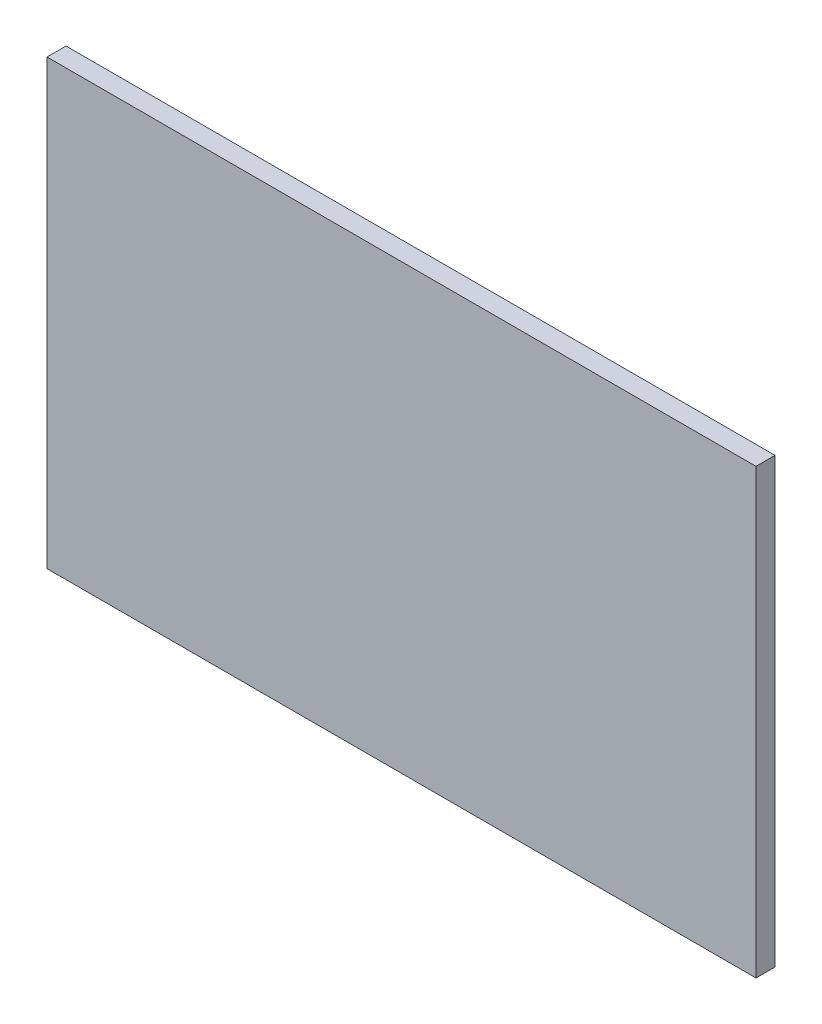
ISO-10303-21;
HEADER;
FILE_DESCRIPTION(('STEP AP214'),'2;1');
FILE_NAME('part.step','',(''),(''),'','','');
FILE_SCHEMA(('AUTOMOTIVE_DESIGN { 1 0 10303 214 1 1 1 1 }'));
ENDSEC;
DATA;
#1=APPLICATION_CONTEXT('core data for automotive mechanical design processes');
#2=APPLICATION_PROTOCOL_DEFINITION('international standard','automotive_design',2000,#1);
#3=PRODUCT_CONTEXT('',#1,'mechanical');
#4=PRODUCT('Part','Part','',(#3));
#5=PRODUCT_RELATED_PRODUCT_CATEGORY('part','',(#4));
#6=PRODUCT_DEFINITION_FORMATION('','',#4);
#7=PRODUCT_DEFINITION_CONTEXT('part definition',#1,'design');
#8=PRODUCT_DEFINITION('design','',#6,#7);
#9=PRODUCT_DEFINITION_SHAPE('','',#8);
#10=(LENGTH_UNIT() NAMED_UNIT(*) SI_UNIT(.MILLI.,.METRE.));
#11=(NAMED_UNIT(*) PLANE_ANGLE_UNIT() SI_UNIT($,.RADIAN.));
#12=(NAMED_UNIT(*) SI_UNIT($,.STERADIAN.) SOLID_ANGLE_UNIT());
#13=UNCERTAINTY_MEASURE_WITH_UNIT(LENGTH_MEASURE(1.E-05),#10,'distance_accuracy_value','');
#14=(GEOMETRIC_REPRESENTATION_CONTEXT(3) GLOBAL_UNCERTAINTY_ASSIGNED_CONTEXT((#13)) GLOBAL_UNIT_ASSIGNED_CONTEXT((#10,
#11,#12)) REPRESENTATION_CONTEXT('',''));
#15=CARTESIAN_POINT('',(0.,0.,0.));
#16=DIRECTION('',(0.,0.,1.));
#17=DIRECTION('',(1.,0.,0.));
#18=AXIS2_PLACEMENT_3D('',#15,#16,#17);
#19=CARTESIAN_POINT('',(0.,35.,1.5));
#20=DIRECTION('',(1.,0.,0.));
#21=DIRECTION('',(0.,1.,0.));
#22=AXIS2_PLACEMENT_3D('',#19,#20,#21);
#23=PLANE('',#22);
#24=DIRECTION('',(0.,-1.,0.));
#25=VECTOR('',#24,1.);
#26=CARTESIAN_POINT('',(0.,35.,0.));
#27=LINE('',#26,#25);
#28=CARTESIAN_POINT('',(0.,35.,0.));
#29=VERTEX_POINT('',#28);
#30=CARTESIAN_POINT('',(0.,0.,0.));
#31=VERTEX_POINT('',#30);
#32=EDGE_CURVE('E392',#29,#31,#27,.T.);
#33=ORIENTED_EDGE('',*,*,#32,.T.);
#34=DIRECTION('',(0.,0.,-1.));
#35=VECTOR('',#34,1.);
#36=CARTESIAN_POINT('',(0.,0.,1.5));
#37=LINE('',#36,#35);
#38=CARTESIAN_POINT('',(0.,0.,1.5));
#39=VERTEX_POINT('',#38);
#40=EDGE_CURVE('E11',#39,#31,#37,.T.);
#41=ORIENTED_EDGE('',*,*,#40,.F.);
#42=DIRECTION('',(0.,-1.,0.));
#43=VECTOR('',#42,1.);
#44=CARTESIAN_POINT('',(0.,35.,1.5));
#45=LINE('',#44,#43);
#46=CARTESIAN_POINT('',(0.,35.,1.5));
#47=VERTEX_POINT('',#46);
#48=EDGE_CURVE('E410',#47,#39,#45,.T.);
#49=ORIENTED_EDGE('',*,*,#48,.F.);
#50=DIRECTION('',(0.,0.,-1.));
#51=VECTOR('',#50,1.);
#52=CARTESIAN_POINT('',(0.,35.,1.5));
#53=LINE('',#52,#51);
#54=EDGE_CURVE('E404',#47,#29,#53,.T.);
#55=ORIENTED_EDGE('',*,*,#54,.T.);
#56=EDGE_LOOP('',(#33,#41,#49,#55));
#57=FACE_BOUND('',#56,.T.);
#58=ADVANCED_FACE('F348',(#57),#23,.F.);
#59=CARTESIAN_POINT('',(0.,0.,1.5));
#60=DIRECTION('',(0.,1.,0.));
#61=DIRECTION('',(-1.,0.,0.));
#62=AXIS2_PLACEMENT_3D('',#59,#60,#61);
#63=PLANE('',#62);
#64=DIRECTION('',(1.,0.,0.));
#65=VECTOR('',#64,1.);
#66=CARTESIAN_POINT('',(0.,0.,0.));
#67=LINE('',#66,#65);
#68=CARTESIAN_POINT('',(56.,0.,0.));
#69=VERTEX_POINT('',#68);
#70=EDGE_CURVE('E388',#31,#69,#67,.T.);
#71=ORIENTED_EDGE('',*,*,#70,.T.);
#72=DIRECTION('',(0.,0.,-1.));
#73=VECTOR('',#72,1.);
#74=CARTESIAN_POINT('',(56.,0.,1.5));
#75=LINE('',#74,#73);
#76=CARTESIAN_POINT('',(56.,0.,1.5));
#77=VERTEX_POINT('',#76);
#78=EDGE_CURVE('E355',#77,#69,#75,.T.);
#79=ORIENTED_EDGE('',*,*,#78,.F.);
#80=DIRECTION('',(1.,0.,0.));
#81=VECTOR('',#80,1.);
#82=CARTESIAN_POINT('',(0.,0.,1.5));
#83=LINE('',#82,#81);
#84=EDGE_CURVE('E400',#39,#77,#83,.T.);
#85=ORIENTED_EDGE('',*,*,#84,.F.);
#86=ORIENTED_EDGE('',*,*,#40,.T.);
#87=EDGE_LOOP('',(#71,#79,#85,#86));
#88=FACE_BOUND('',#87,.T.);
#89=ADVANCED_FACE('F399',(#88),#63,.F.);
#90=CARTESIAN_POINT('',(56.,35.,1.5));
#91=DIRECTION('',(-1.,0.,0.));
#92=DIRECTION('',(0.,-1.,0.));
#93=AXIS2_PLACEMENT_3D('',#90,#91,#92);
#94=PLANE('',#93);
#95=DIRECTION('',(0.,1.,0.));
#96=VECTOR('',#95,1.);
#97=CARTESIAN_POINT('',(56.,35.,0.));
#98=LINE('',#97,#96);
#99=CARTESIAN_POINT('',(56.,35.,0.));
#100=VERTEX_POINT('',#99);
#101=EDGE_CURVE('E393',#69,#100,#98,.T.);
#102=ORIENTED_EDGE('',*,*,#101,.T.);
#103=DIRECTION('',(0.,0.,-1.));
#104=VECTOR('',#103,1.);
#105=CARTESIAN_POINT('',(56.,35.,1.5));
#106=LINE('',#105,#104);
#107=CARTESIAN_POINT('',(56.,35.,1.5));
#108=VERTEX_POINT('',#107);
#109=EDGE_CURVE('E416',#108,#100,#106,.T.);
#110=ORIENTED_EDGE('',*,*,#109,.F.);
#111=DIRECTION('',(0.,1.,0.));
#112=VECTOR('',#111,1.);
#113=CARTESIAN_POINT('',(56.,35.,1.5));
#114=LINE('',#113,#112);
#115=EDGE_CURVE('E367',#77,#108,#114,.T.);
#116=ORIENTED_EDGE('',*,*,#115,.F.);
#117=ORIENTED_EDGE('',*,*,#78,.T.);
#118=EDGE_LOOP('',(#102,#110,#116,#117));
#119=FACE_BOUND('',#118,.T.);
#120=ADVANCED_FACE('F419',(#119),#94,.F.);
#121=CARTESIAN_POINT('',(0.,35.,1.5));
#122=DIRECTION('',(0.,-1.,0.));
#123=DIRECTION('',(0.,0.,-1.));
#124=AXIS2_PLACEMENT_3D('',#121,#122,#123);
#125=PLANE('',#124);
#126=DIRECTION('',(-1.,0.,0.));
#127=VECTOR('',#126,1.);
#128=CARTESIAN_POINT('',(0.,35.,0.));
#129=LINE('',#128,#127);
#130=EDGE_CURVE('E408',#100,#29,#129,.T.);
#131=ORIENTED_EDGE('',*,*,#130,.T.);
#132=ORIENTED_EDGE('',*,*,#54,.F.);
#133=DIRECTION('',(-1.,0.,0.));
#134=VECTOR('',#133,1.);
#135=CARTESIAN_POINT('',(0.,35.,1.5));
#136=LINE('',#135,#134);
#137=EDGE_CURVE('E362',#108,#47,#136,.T.);
#138=ORIENTED_EDGE('',*,*,#137,.F.);
#139=ORIENTED_EDGE('',*,*,#109,.T.);
#140=EDGE_LOOP('',(#131,#132,#138,#139));
#141=FACE_BOUND('',#140,.T.);
#142=ADVANCED_FACE('F421',(#141),#125,.F.);
#143=CARTESIAN_POINT('',(0.,35.,1.5));
#144=DIRECTION('',(0.,0.,1.));
#145=DIRECTION('',(1.,0.,0.));
#146=AXIS2_PLACEMENT_3D('',#143,#144,#145);
#147=PLANE('',#146);
#148=ORIENTED_EDGE('',*,*,#48,.T.);
#149=ORIENTED_EDGE('',*,*,#84,.T.);
#150=ORIENTED_EDGE('',*,*,#115,.T.);
#151=ORIENTED_EDGE('',*,*,#137,.T.);
#152=EDGE_LOOP('',(#148,#149,#150,#151));
#153=FACE_BOUND('',#152,.T.);
#154=ADVANCED_FACE('F422',(#153),#147,.T.);
#155=CARTESIAN_POINT('',(0.,35.,0.));
#156=DIRECTION('',(0.,0.,1.));
#157=DIRECTION('',(1.,0.,0.));
#158=AXIS2_PLACEMENT_3D('',#155,#156,#157);
#159=PLANE('',#158);
#160=ORIENTED_EDGE('',*,*,#32,.F.);
#161=ORIENTED_EDGE('',*,*,#130,.F.);
#162=ORIENTED_EDGE('',*,*,#101,.F.);
#163=ORIENTED_EDGE('',*,*,#70,.F.);
#164=EDGE_LOOP('',(#160,#161,#162,#163));
#165=FACE_BOUND('',#164,.T.);
#166=ADVANCED_FACE('F389',(#165),#159,.F.);
#167=CLOSED_SHELL('',(#58,#89,#120,#142,#154,#166));
#168=MANIFOLD_SOLID_BREP('B2',#167);
#169=ADVANCED_BREP_SHAPE_REPRESENTATION('',(#18,#168),#14);
#170=SHAPE_DEFINITION_REPRESENTATION(#9,#169);
ENDSEC;
END-ISO-10303-21;
